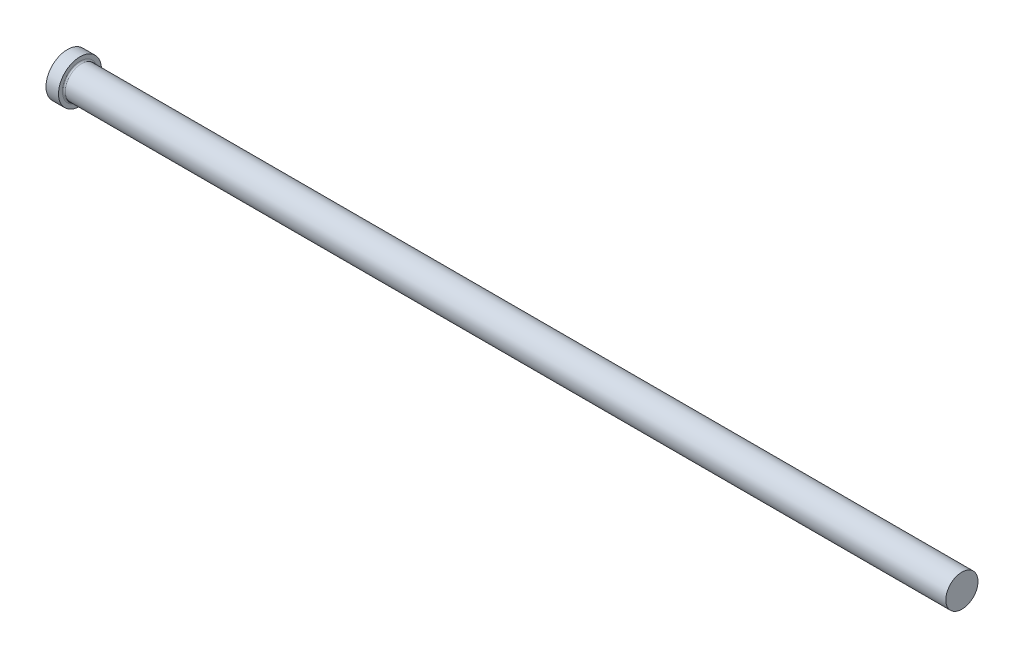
ISO-10303-21;
HEADER;
FILE_DESCRIPTION(('STEP AP214'),'2;1');
FILE_NAME('part.step','',(''),(''),'','','');
FILE_SCHEMA(('AUTOMOTIVE_DESIGN { 1 0 10303 214 1 1 1 1 }'));
ENDSEC;
DATA;
#1=APPLICATION_CONTEXT('core data for automotive mechanical design processes');
#2=APPLICATION_PROTOCOL_DEFINITION('international standard','automotive_design',2000,#1);
#3=PRODUCT_CONTEXT('',#1,'mechanical');
#4=PRODUCT('Part','Part','',(#3));
#5=PRODUCT_RELATED_PRODUCT_CATEGORY('part','',(#4));
#6=PRODUCT_DEFINITION_FORMATION('','',#4);
#7=PRODUCT_DEFINITION_CONTEXT('part definition',#1,'design');
#8=PRODUCT_DEFINITION('design','',#6,#7);
#9=PRODUCT_DEFINITION_SHAPE('','',#8);
#10=(LENGTH_UNIT() NAMED_UNIT(*) SI_UNIT(.MILLI.,.METRE.));
#11=(NAMED_UNIT(*) PLANE_ANGLE_UNIT() SI_UNIT($,.RADIAN.));
#12=(NAMED_UNIT(*) SI_UNIT($,.STERADIAN.) SOLID_ANGLE_UNIT());
#13=UNCERTAINTY_MEASURE_WITH_UNIT(LENGTH_MEASURE(1.E-05),#10,'distance_accuracy_value','');
#14=(GEOMETRIC_REPRESENTATION_CONTEXT(3) GLOBAL_UNCERTAINTY_ASSIGNED_CONTEXT((#13)) GLOBAL_UNIT_ASSIGNED_CONTEXT((#10,
#11,#12)) REPRESENTATION_CONTEXT('',''));
#15=CARTESIAN_POINT('',(0.,0.,0.));
#16=DIRECTION('',(0.,0.,1.));
#17=DIRECTION('',(1.,0.,0.));
#18=AXIS2_PLACEMENT_3D('',#15,#16,#17);
#19=CARTESIAN_POINT('',(0.,0.,0.));
#20=DIRECTION('',(-1.,0.,0.));
#21=DIRECTION('',(0.,-1.,0.));
#22=AXIS2_PLACEMENT_3D('',#19,#20,#21);
#23=PLANE('',#22);
#24=CARTESIAN_POINT('',(0.,0.,0.));
#25=DIRECTION('',(1.,0.,0.));
#26=DIRECTION('',(0.,1.,0.));
#27=AXIS2_PLACEMENT_3D('',#24,#25,#26);
#28=CIRCLE('',#27,12.);
#29=CARTESIAN_POINT('',(0.,12.,0.));
#30=VERTEX_POINT('',#29);
#31=EDGE_CURVE('E25',#30,#30,#28,.T.);
#32=ORIENTED_EDGE('',*,*,#31,.F.);
#33=EDGE_LOOP('',(#32));
#34=FACE_BOUND('',#33,.T.);
#35=ADVANCED_FACE('F14',(#34),#23,.T.);
#36=CARTESIAN_POINT('',(500.,0.,0.));
#37=DIRECTION('',(1.,0.,0.));
#38=DIRECTION('',(0.,1.,0.));
#39=AXIS2_PLACEMENT_3D('',#36,#37,#38);
#40=CYLINDRICAL_SURFACE('',#39,12.);
#41=ORIENTED_EDGE('',*,*,#31,.T.);
#42=EDGE_LOOP('',(#41));
#43=FACE_BOUND('',#42,.T.);
#44=CARTESIAN_POINT('',(7.,0.,0.));
#45=DIRECTION('',(1.,0.,0.));
#46=DIRECTION('',(0.,1.,0.));
#47=AXIS2_PLACEMENT_3D('',#44,#45,#46);
#48=CIRCLE('',#47,12.);
#49=CARTESIAN_POINT('',(7.,12.,0.));
#50=VERTEX_POINT('',#49);
#51=EDGE_CURVE('E29',#50,#50,#48,.T.);
#52=ORIENTED_EDGE('',*,*,#51,.F.);
#53=EDGE_LOOP('',(#52));
#54=FACE_BOUND('',#53,.T.);
#55=ADVANCED_FACE('F51',(#43,#54),#40,.T.);
#56=CARTESIAN_POINT('',(7.,12.,0.));
#57=DIRECTION('',(1.,0.,0.));
#58=DIRECTION('',(0.,1.,0.));
#59=AXIS2_PLACEMENT_3D('',#56,#57,#58);
#60=PLANE('',#59);
#61=CARTESIAN_POINT('',(7.,0.,0.));
#62=DIRECTION('',(1.,0.,0.));
#63=DIRECTION('',(0.,1.,0.));
#64=AXIS2_PLACEMENT_3D('',#61,#62,#63);
#65=CIRCLE('',#64,9.8);
#66=CARTESIAN_POINT('',(7.,9.8,0.));
#67=VERTEX_POINT('',#66);
#68=EDGE_CURVE('E9',#67,#67,#65,.F.);
#69=ORIENTED_EDGE('',*,*,#68,.T.);
#70=EDGE_LOOP('',(#69));
#71=FACE_BOUND('',#70,.T.);
#72=ORIENTED_EDGE('',*,*,#51,.T.);
#73=EDGE_LOOP('',(#72));
#74=FACE_BOUND('',#73,.T.);
#75=ADVANCED_FACE('F42',(#71,#74),#60,.T.);
#76=CARTESIAN_POINT('',(500.,0.,0.));
#77=DIRECTION('',(1.,0.,0.));
#78=DIRECTION('',(0.,1.,0.));
#79=AXIS2_PLACEMENT_3D('',#76,#77,#78);
#80=CYLINDRICAL_SURFACE('',#79,9.);
#81=CARTESIAN_POINT('',(7.8,0.,0.));
#82=DIRECTION('',(1.,0.,0.));
#83=DIRECTION('',(0.,1.,0.));
#84=AXIS2_PLACEMENT_3D('',#81,#82,#83);
#85=CIRCLE('',#84,9.);
#86=CARTESIAN_POINT('',(7.8,9.,0.));
#87=VERTEX_POINT('',#86);
#88=EDGE_CURVE('E21',#87,#87,#85,.T.);
#89=ORIENTED_EDGE('',*,*,#88,.T.);
#90=EDGE_LOOP('',(#89));
#91=FACE_BOUND('',#90,.T.);
#92=CARTESIAN_POINT('',(500.,0.,0.));
#93=DIRECTION('',(1.,0.,0.));
#94=DIRECTION('',(0.,1.,0.));
#95=AXIS2_PLACEMENT_3D('',#92,#93,#94);
#96=CIRCLE('',#95,9.);
#97=CARTESIAN_POINT('',(500.,9.00000000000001,0.));
#98=VERTEX_POINT('',#97);
#99=EDGE_CURVE('E34',#98,#98,#96,.T.);
#100=ORIENTED_EDGE('',*,*,#99,.F.);
#101=EDGE_LOOP('',(#100));
#102=FACE_BOUND('',#101,.T.);
#103=ADVANCED_FACE('F40',(#91,#102),#80,.T.);
#104=CARTESIAN_POINT('',(500.,9.,0.));
#105=DIRECTION('',(1.,0.,0.));
#106=DIRECTION('',(0.,1.,0.));
#107=AXIS2_PLACEMENT_3D('',#104,#105,#106);
#108=PLANE('',#107);
#109=ORIENTED_EDGE('',*,*,#99,.T.);
#110=EDGE_LOOP('',(#109));
#111=FACE_BOUND('',#110,.T.);
#112=ADVANCED_FACE('F38',(#111),#108,.T.);
#113=CARTESIAN_POINT('',(7.8,0.,0.));
#114=DIRECTION('',(1.,0.,0.));
#115=DIRECTION('',(0.,1.,0.));
#116=AXIS2_PLACEMENT_3D('',#113,#114,#115);
#117=TOROIDAL_SURFACE('',#116,9.8,0.8);
#118=ORIENTED_EDGE('',*,*,#68,.F.);
#119=EDGE_LOOP('',(#118));
#120=FACE_BOUND('',#119,.T.);
#121=ORIENTED_EDGE('',*,*,#88,.F.);
#122=EDGE_LOOP('',(#121));
#123=FACE_BOUND('',#122,.T.);
#124=ADVANCED_FACE('F16',(#120,#123),#117,.F.);
#125=CLOSED_SHELL('',(#35,#55,#75,#103,#112,#124));
#126=MANIFOLD_SOLID_BREP('B1',#125);
#127=ADVANCED_BREP_SHAPE_REPRESENTATION('',(#18,#126),#14);
#128=SHAPE_DEFINITION_REPRESENTATION(#9,#127);
ENDSEC;
END-ISO-10303-21;
